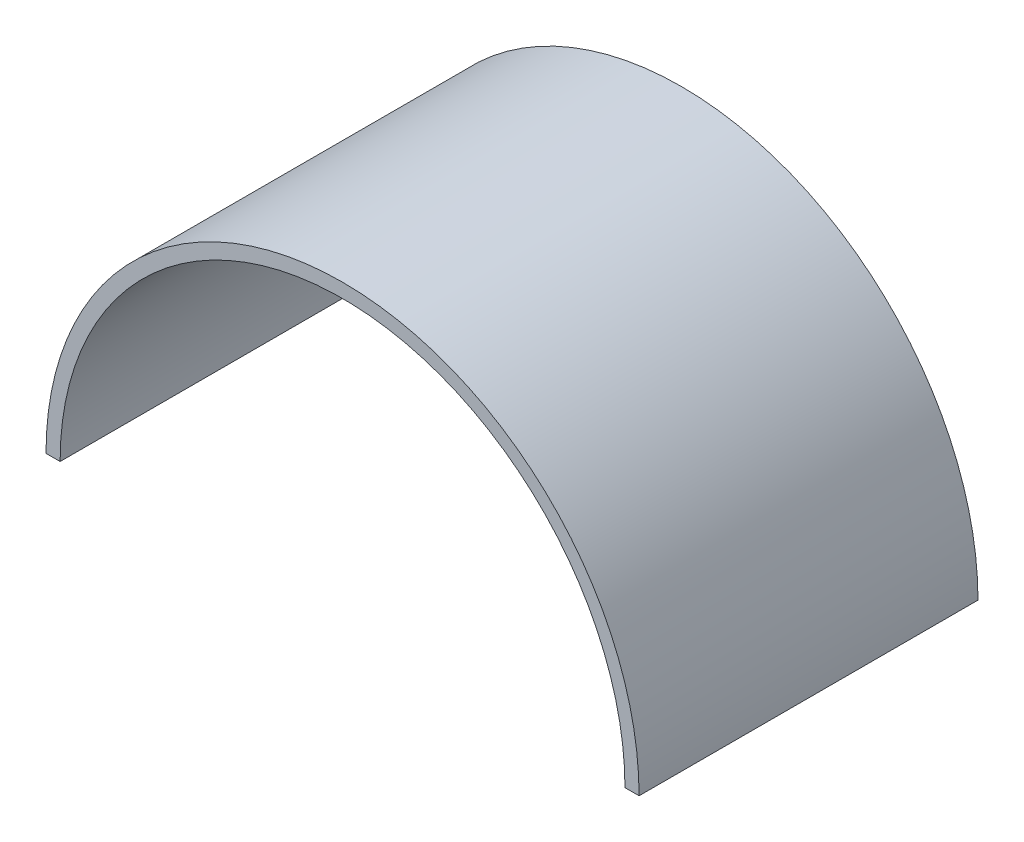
ISO-10303-21;
HEADER;
FILE_DESCRIPTION(('STEP AP214'),'2;1');
FILE_NAME('part.step','',(''),(''),'','','');
FILE_SCHEMA(('AUTOMOTIVE_DESIGN { 1 0 10303 214 1 1 1 1 }'));
ENDSEC;
DATA;
#1=APPLICATION_CONTEXT('core data for automotive mechanical design processes');
#2=APPLICATION_PROTOCOL_DEFINITION('international standard','automotive_design',2000,#1);
#3=PRODUCT_CONTEXT('',#1,'mechanical');
#4=PRODUCT('Part','Part','',(#3));
#5=PRODUCT_RELATED_PRODUCT_CATEGORY('part','',(#4));
#6=PRODUCT_DEFINITION_FORMATION('','',#4);
#7=PRODUCT_DEFINITION_CONTEXT('part definition',#1,'design');
#8=PRODUCT_DEFINITION('design','',#6,#7);
#9=PRODUCT_DEFINITION_SHAPE('','',#8);
#10=(LENGTH_UNIT() NAMED_UNIT(*) SI_UNIT(.MILLI.,.METRE.));
#11=(NAMED_UNIT(*) PLANE_ANGLE_UNIT() SI_UNIT($,.RADIAN.));
#12=(NAMED_UNIT(*) SI_UNIT($,.STERADIAN.) SOLID_ANGLE_UNIT());
#13=UNCERTAINTY_MEASURE_WITH_UNIT(LENGTH_MEASURE(1.E-05),#10,'distance_accuracy_value','');
#14=(GEOMETRIC_REPRESENTATION_CONTEXT(3) GLOBAL_UNCERTAINTY_ASSIGNED_CONTEXT((#13)) GLOBAL_UNIT_ASSIGNED_CONTEXT((#10,
#11,#12)) REPRESENTATION_CONTEXT('',''));
#15=CARTESIAN_POINT('',(0.,0.,0.));
#16=DIRECTION('',(0.,0.,1.));
#17=DIRECTION('',(1.,0.,0.));
#18=AXIS2_PLACEMENT_3D('',#15,#16,#17);
#19=CARTESIAN_POINT('',(-118.872,109.22,76.2));
#20=DIRECTION('',(0.,0.,-1.));
#21=DIRECTION('',(-1.,0.,0.));
#22=AXIS2_PLACEMENT_3D('',#19,#20,#21);
#23=CYLINDRICAL_SURFACE('',#22,63.5);
#24=CARTESIAN_POINT('',(-118.872,109.22,0.));
#25=DIRECTION('',(0.,0.,-1.));
#26=DIRECTION('',(1.,0.,0.));
#27=AXIS2_PLACEMENT_3D('',#24,#25,#26);
#28=CIRCLE('',#27,63.5);
#29=CARTESIAN_POINT('',(-182.372,109.22,0.));
#30=VERTEX_POINT('',#29);
#31=CARTESIAN_POINT('',(-55.372,109.22,0.));
#32=VERTEX_POINT('',#31);
#33=EDGE_CURVE('E96',#30,#32,#28,.T.);
#34=ORIENTED_EDGE('',*,*,#33,.T.);
#35=DIRECTION('',(0.,0.,-1.));
#36=VECTOR('',#35,1.);
#37=CARTESIAN_POINT('',(-55.372,109.22,76.2));
#38=LINE('',#37,#36);
#39=CARTESIAN_POINT('',(-55.372,109.22,76.2));
#40=VERTEX_POINT('',#39);
#41=EDGE_CURVE('E11',#40,#32,#38,.T.);
#42=ORIENTED_EDGE('',*,*,#41,.F.);
#43=CARTESIAN_POINT('',(-118.872,109.22,76.2));
#44=DIRECTION('',(0.,0.,-1.));
#45=DIRECTION('',(1.,0.,0.));
#46=AXIS2_PLACEMENT_3D('',#43,#44,#45);
#47=CIRCLE('',#46,63.5);
#48=CARTESIAN_POINT('',(-182.372,109.22,76.2));
#49=VERTEX_POINT('',#48);
#50=EDGE_CURVE('E84',#49,#40,#47,.T.);
#51=ORIENTED_EDGE('',*,*,#50,.F.);
#52=DIRECTION('',(0.,0.,-1.));
#53=VECTOR('',#52,1.);
#54=CARTESIAN_POINT('',(-182.372,109.22,76.2));
#55=LINE('',#54,#53);
#56=EDGE_CURVE('E92',#49,#30,#55,.T.);
#57=ORIENTED_EDGE('',*,*,#56,.T.);
#58=EDGE_LOOP('',(#34,#42,#51,#57));
#59=FACE_BOUND('',#58,.T.);
#60=ADVANCED_FACE('F33',(#59),#23,.F.);
#61=CARTESIAN_POINT('',(-55.372,109.22,76.2));
#62=DIRECTION('',(0.,1.,0.));
#63=DIRECTION('',(0.,0.,1.));
#64=AXIS2_PLACEMENT_3D('',#61,#62,#63);
#65=PLANE('',#64);
#66=DIRECTION('',(1.,0.,0.));
#67=VECTOR('',#66,1.);
#68=CARTESIAN_POINT('',(-55.372,109.22,0.));
#69=LINE('',#68,#67);
#70=CARTESIAN_POINT('',(-52.197,109.22,0.));
#71=VERTEX_POINT('',#70);
#72=EDGE_CURVE('E88',#32,#71,#69,.T.);
#73=ORIENTED_EDGE('',*,*,#72,.T.);
#74=DIRECTION('',(0.,0.,-1.));
#75=VECTOR('',#74,1.);
#76=CARTESIAN_POINT('',(-52.197,109.22,76.2));
#77=LINE('',#76,#75);
#78=CARTESIAN_POINT('',(-52.197,109.22,76.2));
#79=VERTEX_POINT('',#78);
#80=EDGE_CURVE('E41',#79,#71,#77,.T.);
#81=ORIENTED_EDGE('',*,*,#80,.F.);
#82=DIRECTION('',(1.,0.,0.));
#83=VECTOR('',#82,1.);
#84=CARTESIAN_POINT('',(-55.372,109.22,76.2));
#85=LINE('',#84,#83);
#86=EDGE_CURVE('E79',#40,#79,#85,.T.);
#87=ORIENTED_EDGE('',*,*,#86,.F.);
#88=ORIENTED_EDGE('',*,*,#41,.T.);
#89=EDGE_LOOP('',(#73,#81,#87,#88));
#90=FACE_BOUND('',#89,.T.);
#91=ADVANCED_FACE('F87',(#90),#65,.F.);
#92=CARTESIAN_POINT('',(-118.872,109.22,76.2));
#93=DIRECTION('',(0.,0.,-1.));
#94=DIRECTION('',(-1.,0.,0.));
#95=AXIS2_PLACEMENT_3D('',#92,#93,#94);
#96=CYLINDRICAL_SURFACE('',#95,66.675);
#97=CARTESIAN_POINT('',(-118.872,109.22,0.));
#98=DIRECTION('',(0.,0.,1.));
#99=DIRECTION('',(1.,0.,0.));
#100=AXIS2_PLACEMENT_3D('',#97,#98,#99);
#101=CIRCLE('',#100,66.675);
#102=CARTESIAN_POINT('',(-185.547,109.22,0.));
#103=VERTEX_POINT('',#102);
#104=EDGE_CURVE('E66',#71,#103,#101,.T.);
#105=ORIENTED_EDGE('',*,*,#104,.T.);
#106=DIRECTION('',(0.,0.,-1.));
#107=VECTOR('',#106,1.);
#108=CARTESIAN_POINT('',(-185.547,109.22,76.2));
#109=LINE('',#108,#107);
#110=CARTESIAN_POINT('',(-185.547,109.22,76.2));
#111=VERTEX_POINT('',#110);
#112=EDGE_CURVE('E89',#111,#103,#109,.T.);
#113=ORIENTED_EDGE('',*,*,#112,.F.);
#114=CARTESIAN_POINT('',(-118.872,109.22,76.2));
#115=DIRECTION('',(0.,0.,1.));
#116=DIRECTION('',(1.,0.,0.));
#117=AXIS2_PLACEMENT_3D('',#114,#115,#116);
#118=CIRCLE('',#117,66.675);
#119=EDGE_CURVE('E82',#79,#111,#118,.T.);
#120=ORIENTED_EDGE('',*,*,#119,.F.);
#121=ORIENTED_EDGE('',*,*,#80,.T.);
#122=EDGE_LOOP('',(#105,#113,#120,#121));
#123=FACE_BOUND('',#122,.T.);
#124=ADVANCED_FACE('F90',(#123),#96,.T.);
#125=CARTESIAN_POINT('',(-182.372,109.22,76.2));
#126=DIRECTION('',(0.,1.,0.));
#127=DIRECTION('',(-1.,0.,0.));
#128=AXIS2_PLACEMENT_3D('',#125,#126,#127);
#129=PLANE('',#128);
#130=DIRECTION('',(1.,0.,0.));
#131=VECTOR('',#130,1.);
#132=CARTESIAN_POINT('',(-182.372,109.22,0.));
#133=LINE('',#132,#131);
#134=EDGE_CURVE('E72',#103,#30,#133,.T.);
#135=ORIENTED_EDGE('',*,*,#134,.T.);
#136=ORIENTED_EDGE('',*,*,#56,.F.);
#137=DIRECTION('',(1.,0.,0.));
#138=VECTOR('',#137,1.);
#139=CARTESIAN_POINT('',(-182.372,109.22,76.2));
#140=LINE('',#139,#138);
#141=EDGE_CURVE('E49',#111,#49,#140,.T.);
#142=ORIENTED_EDGE('',*,*,#141,.F.);
#143=ORIENTED_EDGE('',*,*,#112,.T.);
#144=EDGE_LOOP('',(#135,#136,#142,#143));
#145=FACE_BOUND('',#144,.T.);
#146=ADVANCED_FACE('F103',(#145),#129,.F.);
#147=CARTESIAN_POINT('',(-118.872,109.22,76.2));
#148=DIRECTION('',(0.,0.,1.));
#149=DIRECTION('',(1.,0.,0.));
#150=AXIS2_PLACEMENT_3D('',#147,#148,#149);
#151=PLANE('',#150);
#152=ORIENTED_EDGE('',*,*,#50,.T.);
#153=ORIENTED_EDGE('',*,*,#86,.T.);
#154=ORIENTED_EDGE('',*,*,#119,.T.);
#155=ORIENTED_EDGE('',*,*,#141,.T.);
#156=EDGE_LOOP('',(#152,#153,#154,#155));
#157=FACE_BOUND('',#156,.T.);
#158=ADVANCED_FACE('F80',(#157),#151,.T.);
#159=CARTESIAN_POINT('',(-118.872,109.22,0.));
#160=DIRECTION('',(0.,0.,1.));
#161=DIRECTION('',(1.,0.,0.));
#162=AXIS2_PLACEMENT_3D('',#159,#160,#161);
#163=PLANE('',#162);
#164=ORIENTED_EDGE('',*,*,#33,.F.);
#165=ORIENTED_EDGE('',*,*,#134,.F.);
#166=ORIENTED_EDGE('',*,*,#104,.F.);
#167=ORIENTED_EDGE('',*,*,#72,.F.);
#168=EDGE_LOOP('',(#164,#165,#166,#167));
#169=FACE_BOUND('',#168,.T.);
#170=ADVANCED_FACE('F106',(#169),#163,.F.);
#171=CLOSED_SHELL('',(#60,#91,#124,#146,#158,#170));
#172=MANIFOLD_SOLID_BREP('B2',#171);
#173=ADVANCED_BREP_SHAPE_REPRESENTATION('',(#18,#172),#14);
#174=SHAPE_DEFINITION_REPRESENTATION(#9,#173);
ENDSEC;
END-ISO-10303-21;
